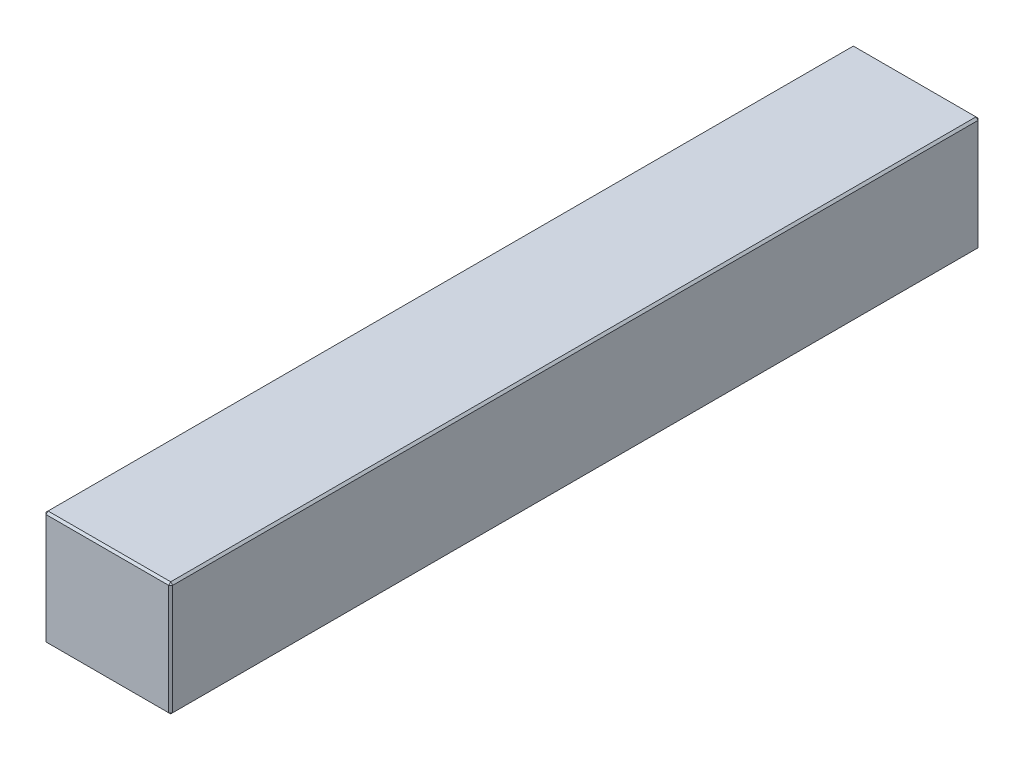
ISO-10303-21;
HEADER;
FILE_DESCRIPTION(('STEP AP214'),'2;1');
FILE_NAME('part.step','',(''),(''),'','','');
FILE_SCHEMA(('AUTOMOTIVE_DESIGN { 1 0 10303 214 1 1 1 1 }'));
ENDSEC;
DATA;
#1=APPLICATION_CONTEXT('core data for automotive mechanical design processes');
#2=APPLICATION_PROTOCOL_DEFINITION('international standard','automotive_design',2000,#1);
#3=PRODUCT_CONTEXT('',#1,'mechanical');
#4=PRODUCT('Part','Part','',(#3));
#5=PRODUCT_RELATED_PRODUCT_CATEGORY('part','',(#4));
#6=PRODUCT_DEFINITION_FORMATION('','',#4);
#7=PRODUCT_DEFINITION_CONTEXT('part definition',#1,'design');
#8=PRODUCT_DEFINITION('design','',#6,#7);
#9=PRODUCT_DEFINITION_SHAPE('','',#8);
#10=(LENGTH_UNIT() NAMED_UNIT(*) SI_UNIT(.MILLI.,.METRE.));
#11=(NAMED_UNIT(*) PLANE_ANGLE_UNIT() SI_UNIT($,.RADIAN.));
#12=(NAMED_UNIT(*) SI_UNIT($,.STERADIAN.) SOLID_ANGLE_UNIT());
#13=UNCERTAINTY_MEASURE_WITH_UNIT(LENGTH_MEASURE(1.E-05),#10,'distance_accuracy_value','');
#14=(GEOMETRIC_REPRESENTATION_CONTEXT(3) GLOBAL_UNCERTAINTY_ASSIGNED_CONTEXT((#13)) GLOBAL_UNIT_ASSIGNED_CONTEXT((#10,
#11,#12)) REPRESENTATION_CONTEXT('',''));
#15=CARTESIAN_POINT('',(0.,0.,0.));
#16=DIRECTION('',(0.,0.,1.));
#17=DIRECTION('',(1.,0.,0.));
#18=AXIS2_PLACEMENT_3D('',#15,#16,#17);
#19=CARTESIAN_POINT('',(-31.,56.,198.));
#20=DIRECTION('',(1.,0.,0.));
#21=DIRECTION('',(0.,0.,-1.));
#22=AXIS2_PLACEMENT_3D('',#19,#20,#21);
#23=PLANE('',#22);
#24=DIRECTION('',(0.,-1.,0.));
#25=VECTOR('',#24,1.);
#26=CARTESIAN_POINT('',(-31.,56.,-197.));
#27=LINE('',#26,#25);
#28=CARTESIAN_POINT('',(-31.,55.,-197.));
#29=VERTEX_POINT('',#28);
#30=CARTESIAN_POINT('',(-31.,1.00000000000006,-197.));
#31=VERTEX_POINT('',#30);
#32=EDGE_CURVE('E114',#29,#31,#27,.T.);
#33=ORIENTED_EDGE('',*,*,#32,.T.);
#34=DIRECTION('',(0.,0.,1.));
#35=VECTOR('',#34,1.);
#36=CARTESIAN_POINT('',(-31.,1.00000000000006,198.));
#37=LINE('',#36,#35);
#38=CARTESIAN_POINT('',(-31.,1.00000000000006,197.));
#39=VERTEX_POINT('',#38);
#40=EDGE_CURVE('E110',#31,#39,#37,.T.);
#41=ORIENTED_EDGE('',*,*,#40,.T.);
#42=DIRECTION('',(0.,1.,0.));
#43=VECTOR('',#42,1.);
#44=CARTESIAN_POINT('',(-31.,56.,197.));
#45=LINE('',#44,#43);
#46=CARTESIAN_POINT('',(-31.,55.,197.));
#47=VERTEX_POINT('',#46);
#48=EDGE_CURVE('E103',#39,#47,#45,.T.);
#49=ORIENTED_EDGE('',*,*,#48,.T.);
#50=DIRECTION('',(0.,0.,-1.));
#51=VECTOR('',#50,1.);
#52=CARTESIAN_POINT('',(-31.,55.,-198.));
#53=LINE('',#52,#51);
#54=EDGE_CURVE('E107',#47,#29,#53,.T.);
#55=ORIENTED_EDGE('',*,*,#54,.T.);
#56=EDGE_LOOP('',(#33,#41,#49,#55));
#57=FACE_BOUND('',#56,.T.);
#58=ADVANCED_FACE('F15',(#57),#23,.F.);
#59=CARTESIAN_POINT('',(31.,56.,198.));
#60=DIRECTION('',(0.,0.,-1.));
#61=DIRECTION('',(-1.,0.,0.));
#62=AXIS2_PLACEMENT_3D('',#59,#60,#61);
#63=PLANE('',#62);
#64=DIRECTION('',(-1.,0.,0.));
#65=VECTOR('',#64,1.);
#66=CARTESIAN_POINT('',(-31.,55.,198.));
#67=LINE('',#66,#65);
#68=CARTESIAN_POINT('',(30.,55.,198.));
#69=VERTEX_POINT('',#68);
#70=CARTESIAN_POINT('',(-30.,55.,198.));
#71=VERTEX_POINT('',#70);
#72=EDGE_CURVE('E164',#69,#71,#67,.T.);
#73=ORIENTED_EDGE('',*,*,#72,.T.);
#74=DIRECTION('',(0.,-1.,0.));
#75=VECTOR('',#74,1.);
#76=CARTESIAN_POINT('',(-30.,56.,198.));
#77=LINE('',#76,#75);
#78=CARTESIAN_POINT('',(-30.,1.00000000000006,198.));
#79=VERTEX_POINT('',#78);
#80=EDGE_CURVE('E122',#71,#79,#77,.T.);
#81=ORIENTED_EDGE('',*,*,#80,.T.);
#82=DIRECTION('',(1.,0.,0.));
#83=VECTOR('',#82,1.);
#84=CARTESIAN_POINT('',(31.,1.00000000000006,198.));
#85=LINE('',#84,#83);
#86=CARTESIAN_POINT('',(30.,1.00000000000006,198.));
#87=VERTEX_POINT('',#86);
#88=EDGE_CURVE('E168',#79,#87,#85,.T.);
#89=ORIENTED_EDGE('',*,*,#88,.T.);
#90=DIRECTION('',(0.,1.,0.));
#91=VECTOR('',#90,1.);
#92=CARTESIAN_POINT('',(30.,56.,198.));
#93=LINE('',#92,#91);
#94=EDGE_CURVE('E166',#87,#69,#93,.T.);
#95=ORIENTED_EDGE('',*,*,#94,.T.);
#96=EDGE_LOOP('',(#73,#81,#89,#95));
#97=FACE_BOUND('',#96,.T.);
#98=ADVANCED_FACE('F275',(#97),#63,.F.);
#99=CARTESIAN_POINT('',(31.,56.,198.));
#100=DIRECTION('',(-1.,0.,0.));
#101=DIRECTION('',(0.,0.,1.));
#102=AXIS2_PLACEMENT_3D('',#99,#100,#101);
#103=PLANE('',#102);
#104=DIRECTION('',(0.,0.,-1.));
#105=VECTOR('',#104,1.);
#106=CARTESIAN_POINT('',(31.,1.00000000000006,198.));
#107=LINE('',#106,#105);
#108=CARTESIAN_POINT('',(31.,1.00000000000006,197.));
#109=VERTEX_POINT('',#108);
#110=CARTESIAN_POINT('',(31.,1.00000000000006,-197.));
#111=VERTEX_POINT('',#110);
#112=EDGE_CURVE('E159',#109,#111,#107,.T.);
#113=ORIENTED_EDGE('',*,*,#112,.T.);
#114=DIRECTION('',(0.,1.,0.));
#115=VECTOR('',#114,1.);
#116=CARTESIAN_POINT('',(31.,56.,-197.));
#117=LINE('',#116,#115);
#118=CARTESIAN_POINT('',(31.,55.,-197.));
#119=VERTEX_POINT('',#118);
#120=EDGE_CURVE('E161',#111,#119,#117,.T.);
#121=ORIENTED_EDGE('',*,*,#120,.T.);
#122=DIRECTION('',(0.,0.,1.));
#123=VECTOR('',#122,1.);
#124=CARTESIAN_POINT('',(31.,55.,198.));
#125=LINE('',#124,#123);
#126=CARTESIAN_POINT('',(31.,55.,197.));
#127=VERTEX_POINT('',#126);
#128=EDGE_CURVE('E155',#119,#127,#125,.T.);
#129=ORIENTED_EDGE('',*,*,#128,.T.);
#130=DIRECTION('',(0.,-1.,0.));
#131=VECTOR('',#130,1.);
#132=CARTESIAN_POINT('',(31.,56.,197.));
#133=LINE('',#132,#131);
#134=EDGE_CURVE('E157',#127,#109,#133,.T.);
#135=ORIENTED_EDGE('',*,*,#134,.T.);
#136=EDGE_LOOP('',(#113,#121,#129,#135));
#137=FACE_BOUND('',#136,.T.);
#138=ADVANCED_FACE('F254',(#137),#103,.F.);
#139=CARTESIAN_POINT('',(31.,56.,-198.));
#140=DIRECTION('',(0.,0.,1.));
#141=DIRECTION('',(1.,0.,0.));
#142=AXIS2_PLACEMENT_3D('',#139,#140,#141);
#143=PLANE('',#142);
#144=DIRECTION('',(0.,-1.,0.));
#145=VECTOR('',#144,1.);
#146=CARTESIAN_POINT('',(30.,56.,-198.));
#147=LINE('',#146,#145);
#148=CARTESIAN_POINT('',(30.,55.,-198.));
#149=VERTEX_POINT('',#148);
#150=CARTESIAN_POINT('',(30.,1.00000000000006,-198.));
#151=VERTEX_POINT('',#150);
#152=EDGE_CURVE('E148',#149,#151,#147,.T.);
#153=ORIENTED_EDGE('',*,*,#152,.T.);
#154=DIRECTION('',(-1.,0.,0.));
#155=VECTOR('',#154,1.);
#156=CARTESIAN_POINT('',(31.,1.00000000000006,-198.));
#157=LINE('',#156,#155);
#158=CARTESIAN_POINT('',(-30.,1.00000000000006,-198.));
#159=VERTEX_POINT('',#158);
#160=EDGE_CURVE('E153',#151,#159,#157,.T.);
#161=ORIENTED_EDGE('',*,*,#160,.T.);
#162=DIRECTION('',(0.,1.,0.));
#163=VECTOR('',#162,1.);
#164=CARTESIAN_POINT('',(-30.,56.,-198.));
#165=LINE('',#164,#163);
#166=CARTESIAN_POINT('',(-30.,55.,-198.));
#167=VERTEX_POINT('',#166);
#168=EDGE_CURVE('E150',#159,#167,#165,.T.);
#169=ORIENTED_EDGE('',*,*,#168,.T.);
#170=DIRECTION('',(1.,0.,0.));
#171=VECTOR('',#170,1.);
#172=CARTESIAN_POINT('',(31.,55.,-198.));
#173=LINE('',#172,#171);
#174=EDGE_CURVE('E146',#167,#149,#173,.T.);
#175=ORIENTED_EDGE('',*,*,#174,.T.);
#176=EDGE_LOOP('',(#153,#161,#169,#175));
#177=FACE_BOUND('',#176,.T.);
#178=ADVANCED_FACE('F284',(#177),#143,.F.);
#179=CARTESIAN_POINT('',(0.,56.,0.));
#180=DIRECTION('',(0.,1.,0.));
#181=DIRECTION('',(0.,0.,1.));
#182=AXIS2_PLACEMENT_3D('',#179,#180,#181);
#183=PLANE('',#182);
#184=DIRECTION('',(0.,0.,-1.));
#185=VECTOR('',#184,1.);
#186=CARTESIAN_POINT('',(30.,56.,-198.));
#187=LINE('',#186,#185);
#188=CARTESIAN_POINT('',(30.,56.,197.));
#189=VERTEX_POINT('',#188);
#190=CARTESIAN_POINT('',(30.,56.,-197.));
#191=VERTEX_POINT('',#190);
#192=EDGE_CURVE('E24',#189,#191,#187,.T.);
#193=ORIENTED_EDGE('',*,*,#192,.T.);
#194=DIRECTION('',(-1.,0.,0.));
#195=VECTOR('',#194,1.);
#196=CARTESIAN_POINT('',(-31.,56.,-197.));
#197=LINE('',#196,#195);
#198=CARTESIAN_POINT('',(-30.,56.,-197.));
#199=VERTEX_POINT('',#198);
#200=EDGE_CURVE('E9',#191,#199,#197,.T.);
#201=ORIENTED_EDGE('',*,*,#200,.T.);
#202=DIRECTION('',(0.,0.,1.));
#203=VECTOR('',#202,1.);
#204=CARTESIAN_POINT('',(-30.,56.,198.));
#205=LINE('',#204,#203);
#206=CARTESIAN_POINT('',(-30.,56.,197.));
#207=VERTEX_POINT('',#206);
#208=EDGE_CURVE('E180',#199,#207,#205,.T.);
#209=ORIENTED_EDGE('',*,*,#208,.T.);
#210=DIRECTION('',(1.,0.,0.));
#211=VECTOR('',#210,1.);
#212=CARTESIAN_POINT('',(31.,56.,197.));
#213=LINE('',#212,#211);
#214=EDGE_CURVE('E35',#207,#189,#213,.T.);
#215=ORIENTED_EDGE('',*,*,#214,.T.);
#216=EDGE_LOOP('',(#193,#201,#209,#215));
#217=FACE_BOUND('',#216,.T.);
#218=ADVANCED_FACE('F350',(#217),#183,.T.);
#219=CARTESIAN_POINT('',(0.,0.,0.));
#220=DIRECTION('',(0.,1.,0.));
#221=DIRECTION('',(0.,0.,1.));
#222=AXIS2_PLACEMENT_3D('',#219,#220,#221);
#223=PLANE('',#222);
#224=DIRECTION('',(0.,0.,1.));
#225=VECTOR('',#224,1.);
#226=CARTESIAN_POINT('',(30.,0.,0.));
#227=LINE('',#226,#225);
#228=CARTESIAN_POINT('',(30.,0.,-197.));
#229=VERTEX_POINT('',#228);
#230=CARTESIAN_POINT('',(30.,0.,197.));
#231=VERTEX_POINT('',#230);
#232=EDGE_CURVE('E171',#229,#231,#227,.T.);
#233=ORIENTED_EDGE('',*,*,#232,.T.);
#234=DIRECTION('',(-1.,0.,0.));
#235=VECTOR('',#234,1.);
#236=CARTESIAN_POINT('',(0.,0.,197.));
#237=LINE('',#236,#235);
#238=CARTESIAN_POINT('',(-30.,0.,197.));
#239=VERTEX_POINT('',#238);
#240=EDGE_CURVE('E177',#231,#239,#237,.T.);
#241=ORIENTED_EDGE('',*,*,#240,.T.);
#242=DIRECTION('',(0.,0.,-1.));
#243=VECTOR('',#242,1.);
#244=CARTESIAN_POINT('',(-30.,0.,0.));
#245=LINE('',#244,#243);
#246=CARTESIAN_POINT('',(-30.,0.,-197.));
#247=VERTEX_POINT('',#246);
#248=EDGE_CURVE('E175',#239,#247,#245,.T.);
#249=ORIENTED_EDGE('',*,*,#248,.T.);
#250=DIRECTION('',(1.,0.,0.));
#251=VECTOR('',#250,1.);
#252=CARTESIAN_POINT('',(0.,0.,-197.));
#253=LINE('',#252,#251);
#254=EDGE_CURVE('E173',#247,#229,#253,.T.);
#255=ORIENTED_EDGE('',*,*,#254,.T.);
#256=EDGE_LOOP('',(#233,#241,#249,#255));
#257=FACE_BOUND('',#256,.T.);
#258=ADVANCED_FACE('F246',(#257),#223,.F.);
#259=CARTESIAN_POINT('',(31.,56.,197.));
#260=DIRECTION('',(-0.707106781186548,0.,-0.707106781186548));
#261=DIRECTION('',(0.,-1.,0.));
#262=AXIS2_PLACEMENT_3D('',#259,#260,#261);
#263=PLANE('',#262);
#264=DIRECTION('',(-0.707106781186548,0.,0.707106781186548));
#265=VECTOR('',#264,1.);
#266=CARTESIAN_POINT('',(30.,55.,198.));
#267=LINE('',#266,#265);
#268=EDGE_CURVE('E19',#69,#127,#267,.F.);
#269=ORIENTED_EDGE('',*,*,#268,.F.);
#270=ORIENTED_EDGE('',*,*,#94,.F.);
#271=DIRECTION('',(0.707106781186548,0.,-0.707106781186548));
#272=VECTOR('',#271,1.);
#273=CARTESIAN_POINT('',(30.,1.00000000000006,198.));
#274=LINE('',#273,#272);
#275=EDGE_CURVE('E142',#109,#87,#274,.F.);
#276=ORIENTED_EDGE('',*,*,#275,.F.);
#277=ORIENTED_EDGE('',*,*,#134,.F.);
#278=EDGE_LOOP('',(#269,#270,#276,#277));
#279=FACE_BOUND('',#278,.T.);
#280=ADVANCED_FACE('F17',(#279),#263,.F.);
#281=CARTESIAN_POINT('',(30.,55.,198.));
#282=DIRECTION('',(0.577350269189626,0.577350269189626,0.577350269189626));
#283=DIRECTION('',(0.707106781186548,0.,-0.707106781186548));
#284=AXIS2_PLACEMENT_3D('',#281,#282,#283);
#285=PLANE('',#284);
#286=DIRECTION('',(0.,-0.707106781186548,0.707106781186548));
#287=VECTOR('',#286,1.);
#288=CARTESIAN_POINT('',(30.,55.,198.));
#289=LINE('',#288,#287);
#290=EDGE_CURVE('E226',#69,#189,#289,.F.);
#291=ORIENTED_EDGE('',*,*,#290,.F.);
#292=ORIENTED_EDGE('',*,*,#268,.T.);
#293=DIRECTION('',(-0.707106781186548,0.707106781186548,0.));
#294=VECTOR('',#293,1.);
#295=CARTESIAN_POINT('',(30.5,55.5,197.));
#296=LINE('',#295,#294);
#297=EDGE_CURVE('E228',#189,#127,#296,.F.);
#298=ORIENTED_EDGE('',*,*,#297,.F.);
#299=EDGE_LOOP('',(#291,#292,#298));
#300=FACE_BOUND('',#299,.T.);
#301=ADVANCED_FACE('F270',(#300),#285,.T.);
#302=CARTESIAN_POINT('',(30.,1.00000000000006,198.));
#303=DIRECTION('',(0.577350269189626,-0.577350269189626,0.577350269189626));
#304=DIRECTION('',(0.707106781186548,0.,-0.707106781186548));
#305=AXIS2_PLACEMENT_3D('',#302,#303,#304);
#306=PLANE('',#305);
#307=DIRECTION('',(-0.707106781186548,-0.707106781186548,0.));
#308=VECTOR('',#307,1.);
#309=CARTESIAN_POINT('',(30.5,0.500000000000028,197.));
#310=LINE('',#309,#308);
#311=EDGE_CURVE('E220',#109,#231,#310,.T.);
#312=ORIENTED_EDGE('',*,*,#311,.F.);
#313=ORIENTED_EDGE('',*,*,#275,.T.);
#314=DIRECTION('',(0.,0.707106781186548,0.707106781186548));
#315=VECTOR('',#314,1.);
#316=CARTESIAN_POINT('',(30.,1.00000000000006,198.));
#317=LINE('',#316,#315);
#318=EDGE_CURVE('E223',#231,#87,#317,.T.);
#319=ORIENTED_EDGE('',*,*,#318,.F.);
#320=EDGE_LOOP('',(#312,#313,#319));
#321=FACE_BOUND('',#320,.T.);
#322=ADVANCED_FACE('F235',(#321),#306,.T.);
#323=CARTESIAN_POINT('',(30.,56.,0.));
#324=DIRECTION('',(0.707106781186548,0.707106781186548,0.));
#325=DIRECTION('',(0.,0.,1.));
#326=AXIS2_PLACEMENT_3D('',#323,#324,#325);
#327=PLANE('',#326);
#328=ORIENTED_EDGE('',*,*,#297,.T.);
#329=ORIENTED_EDGE('',*,*,#128,.F.);
#330=DIRECTION('',(0.707106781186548,-0.707106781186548,0.));
#331=VECTOR('',#330,1.);
#332=CARTESIAN_POINT('',(31.,55.,-197.));
#333=LINE('',#332,#331);
#334=EDGE_CURVE('E215',#191,#119,#333,.T.);
#335=ORIENTED_EDGE('',*,*,#334,.F.);
#336=ORIENTED_EDGE('',*,*,#192,.F.);
#337=EDGE_LOOP('',(#328,#329,#335,#336));
#338=FACE_BOUND('',#337,.T.);
#339=ADVANCED_FACE('F265',(#338),#327,.T.);
#340=CARTESIAN_POINT('',(0.,56.,197.));
#341=DIRECTION('',(0.,0.707106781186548,0.707106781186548));
#342=DIRECTION('',(-1.,0.,0.));
#343=AXIS2_PLACEMENT_3D('',#340,#341,#342);
#344=PLANE('',#343);
#345=ORIENTED_EDGE('',*,*,#290,.T.);
#346=ORIENTED_EDGE('',*,*,#214,.F.);
#347=DIRECTION('',(0.,0.707106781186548,-0.707106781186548));
#348=VECTOR('',#347,1.);
#349=CARTESIAN_POINT('',(-30.,55.5,197.5));
#350=LINE('',#349,#348);
#351=EDGE_CURVE('E126',#71,#207,#350,.T.);
#352=ORIENTED_EDGE('',*,*,#351,.F.);
#353=ORIENTED_EDGE('',*,*,#72,.F.);
#354=EDGE_LOOP('',(#345,#346,#352,#353));
#355=FACE_BOUND('',#354,.T.);
#356=ADVANCED_FACE('F273',(#355),#344,.T.);
#357=CARTESIAN_POINT('',(-30.,56.,198.));
#358=DIRECTION('',(0.707106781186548,0.,-0.707106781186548));
#359=DIRECTION('',(0.,-1.,0.));
#360=AXIS2_PLACEMENT_3D('',#357,#358,#359);
#361=PLANE('',#360);
#362=DIRECTION('',(0.707106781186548,0.,0.707106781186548));
#363=VECTOR('',#362,1.);
#364=CARTESIAN_POINT('',(-30.,1.00000000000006,198.));
#365=LINE('',#364,#363);
#366=EDGE_CURVE('E127',#79,#39,#365,.F.);
#367=ORIENTED_EDGE('',*,*,#366,.F.);
#368=ORIENTED_EDGE('',*,*,#80,.F.);
#369=DIRECTION('',(-0.707106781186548,0.,-0.707106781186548));
#370=VECTOR('',#369,1.);
#371=CARTESIAN_POINT('',(-31.,55.,197.));
#372=LINE('',#371,#370);
#373=EDGE_CURVE('E118',#47,#71,#372,.F.);
#374=ORIENTED_EDGE('',*,*,#373,.F.);
#375=ORIENTED_EDGE('',*,*,#48,.F.);
#376=EDGE_LOOP('',(#367,#368,#374,#375));
#377=FACE_BOUND('',#376,.T.);
#378=ADVANCED_FACE('F120',(#377),#361,.F.);
#379=CARTESIAN_POINT('',(31.,1.00000000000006,198.));
#380=DIRECTION('',(0.,0.707106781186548,-0.707106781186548));
#381=DIRECTION('',(1.,0.,0.));
#382=AXIS2_PLACEMENT_3D('',#379,#380,#381);
#383=PLANE('',#382);
#384=ORIENTED_EDGE('',*,*,#318,.T.);
#385=ORIENTED_EDGE('',*,*,#88,.F.);
#386=DIRECTION('',(0.,-0.707106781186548,-0.707106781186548));
#387=VECTOR('',#386,1.);
#388=CARTESIAN_POINT('',(-30.,1.00000000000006,198.));
#389=LINE('',#388,#387);
#390=EDGE_CURVE('E211',#239,#79,#389,.F.);
#391=ORIENTED_EDGE('',*,*,#390,.F.);
#392=ORIENTED_EDGE('',*,*,#240,.F.);
#393=EDGE_LOOP('',(#384,#385,#391,#392));
#394=FACE_BOUND('',#393,.T.);
#395=ADVANCED_FACE('F243',(#394),#383,.F.);
#396=CARTESIAN_POINT('',(31.,1.00000000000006,198.));
#397=DIRECTION('',(-0.707106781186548,0.707106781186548,0.));
#398=DIRECTION('',(0.,0.,-1.));
#399=AXIS2_PLACEMENT_3D('',#396,#397,#398);
#400=PLANE('',#399);
#401=ORIENTED_EDGE('',*,*,#311,.T.);
#402=ORIENTED_EDGE('',*,*,#232,.F.);
#403=DIRECTION('',(0.707106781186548,0.707106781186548,0.));
#404=VECTOR('',#403,1.);
#405=CARTESIAN_POINT('',(30.5,0.500000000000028,-197.));
#406=LINE('',#405,#404);
#407=EDGE_CURVE('E208',#111,#229,#406,.F.);
#408=ORIENTED_EDGE('',*,*,#407,.F.);
#409=ORIENTED_EDGE('',*,*,#112,.F.);
#410=EDGE_LOOP('',(#401,#402,#408,#409));
#411=FACE_BOUND('',#410,.T.);
#412=ADVANCED_FACE('F251',(#411),#400,.F.);
#413=CARTESIAN_POINT('',(30.,56.,-198.));
#414=DIRECTION('',(-0.707106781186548,0.,0.707106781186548));
#415=DIRECTION('',(0.,-1.,0.));
#416=AXIS2_PLACEMENT_3D('',#413,#414,#415);
#417=PLANE('',#416);
#418=DIRECTION('',(0.707106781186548,0.,0.707106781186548));
#419=VECTOR('',#418,1.);
#420=CARTESIAN_POINT('',(31.,55.,-197.));
#421=LINE('',#420,#419);
#422=EDGE_CURVE('E217',#119,#149,#421,.F.);
#423=ORIENTED_EDGE('',*,*,#422,.F.);
#424=ORIENTED_EDGE('',*,*,#120,.F.);
#425=DIRECTION('',(-0.707106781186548,0.,-0.707106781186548));
#426=VECTOR('',#425,1.);
#427=CARTESIAN_POINT('',(30.,1.00000000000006,-198.));
#428=LINE('',#427,#426);
#429=EDGE_CURVE('E205',#151,#111,#428,.F.);
#430=ORIENTED_EDGE('',*,*,#429,.F.);
#431=ORIENTED_EDGE('',*,*,#152,.F.);
#432=EDGE_LOOP('',(#423,#424,#430,#431));
#433=FACE_BOUND('',#432,.T.);
#434=ADVANCED_FACE('F258',(#433),#417,.F.);
#435=CARTESIAN_POINT('',(31.,55.,-197.));
#436=DIRECTION('',(0.577350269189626,0.577350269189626,-0.577350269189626));
#437=DIRECTION('',(-0.707106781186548,0.,-0.707106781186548));
#438=AXIS2_PLACEMENT_3D('',#435,#436,#437);
#439=PLANE('',#438);
#440=ORIENTED_EDGE('',*,*,#334,.T.);
#441=ORIENTED_EDGE('',*,*,#422,.T.);
#442=DIRECTION('',(0.,0.707106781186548,0.707106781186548));
#443=VECTOR('',#442,1.);
#444=CARTESIAN_POINT('',(30.,55.5,-197.5));
#445=LINE('',#444,#443);
#446=EDGE_CURVE('E134',#191,#149,#445,.F.);
#447=ORIENTED_EDGE('',*,*,#446,.F.);
#448=EDGE_LOOP('',(#440,#441,#447));
#449=FACE_BOUND('',#448,.T.);
#450=ADVANCED_FACE('F325',(#449),#439,.T.);
#451=CARTESIAN_POINT('',(-31.,55.,197.));
#452=DIRECTION('',(-0.577350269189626,0.577350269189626,0.577350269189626));
#453=DIRECTION('',(0.707106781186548,0.,0.707106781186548));
#454=AXIS2_PLACEMENT_3D('',#451,#452,#453);
#455=PLANE('',#454);
#456=ORIENTED_EDGE('',*,*,#373,.T.);
#457=ORIENTED_EDGE('',*,*,#351,.T.);
#458=DIRECTION('',(-0.707106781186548,-0.707106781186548,0.));
#459=VECTOR('',#458,1.);
#460=CARTESIAN_POINT('',(-31.,55.,197.));
#461=LINE('',#460,#459);
#462=EDGE_CURVE('E130',#47,#207,#461,.F.);
#463=ORIENTED_EDGE('',*,*,#462,.F.);
#464=EDGE_LOOP('',(#456,#457,#463));
#465=FACE_BOUND('',#464,.T.);
#466=ADVANCED_FACE('F131',(#465),#455,.T.);
#467=CARTESIAN_POINT('',(-30.,1.00000000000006,198.));
#468=DIRECTION('',(-0.577350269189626,-0.577350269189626,0.577350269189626));
#469=DIRECTION('',(0.707106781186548,0.,0.707106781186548));
#470=AXIS2_PLACEMENT_3D('',#467,#468,#469);
#471=PLANE('',#470);
#472=ORIENTED_EDGE('',*,*,#390,.T.);
#473=ORIENTED_EDGE('',*,*,#366,.T.);
#474=DIRECTION('',(-0.707106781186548,0.707106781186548,0.));
#475=VECTOR('',#474,1.);
#476=CARTESIAN_POINT('',(-30.5,0.500000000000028,197.));
#477=LINE('',#476,#475);
#478=EDGE_CURVE('E135',#239,#39,#477,.T.);
#479=ORIENTED_EDGE('',*,*,#478,.F.);
#480=EDGE_LOOP('',(#472,#473,#479));
#481=FACE_BOUND('',#480,.T.);
#482=ADVANCED_FACE('F318',(#481),#471,.T.);
#483=CARTESIAN_POINT('',(30.,1.00000000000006,-198.));
#484=DIRECTION('',(0.577350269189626,-0.577350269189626,-0.577350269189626));
#485=DIRECTION('',(-0.707106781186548,0.,-0.707106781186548));
#486=AXIS2_PLACEMENT_3D('',#483,#484,#485);
#487=PLANE('',#486);
#488=ORIENTED_EDGE('',*,*,#429,.T.);
#489=ORIENTED_EDGE('',*,*,#407,.T.);
#490=DIRECTION('',(0.,-0.707106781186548,0.707106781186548));
#491=VECTOR('',#490,1.);
#492=CARTESIAN_POINT('',(30.,1.00000000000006,-198.));
#493=LINE('',#492,#491);
#494=EDGE_CURVE('E198',#151,#229,#493,.T.);
#495=ORIENTED_EDGE('',*,*,#494,.F.);
#496=EDGE_LOOP('',(#488,#489,#495));
#497=FACE_BOUND('',#496,.T.);
#498=ADVANCED_FACE('F314',(#497),#487,.T.);
#499=CARTESIAN_POINT('',(0.,56.,-197.));
#500=DIRECTION('',(0.,0.707106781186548,-0.707106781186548));
#501=DIRECTION('',(1.,0.,0.));
#502=AXIS2_PLACEMENT_3D('',#499,#500,#501);
#503=PLANE('',#502);
#504=ORIENTED_EDGE('',*,*,#446,.T.);
#505=ORIENTED_EDGE('',*,*,#174,.F.);
#506=DIRECTION('',(0.,-0.707106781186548,-0.707106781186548));
#507=VECTOR('',#506,1.);
#508=CARTESIAN_POINT('',(-30.,55.,-198.));
#509=LINE('',#508,#507);
#510=EDGE_CURVE('E195',#199,#167,#509,.T.);
#511=ORIENTED_EDGE('',*,*,#510,.F.);
#512=ORIENTED_EDGE('',*,*,#200,.F.);
#513=EDGE_LOOP('',(#504,#505,#511,#512));
#514=FACE_BOUND('',#513,.T.);
#515=ADVANCED_FACE('F311',(#514),#503,.T.);
#516=CARTESIAN_POINT('',(-30.,56.,0.));
#517=DIRECTION('',(-0.707106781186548,0.707106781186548,0.));
#518=DIRECTION('',(0.,0.,-1.));
#519=AXIS2_PLACEMENT_3D('',#516,#517,#518);
#520=PLANE('',#519);
#521=ORIENTED_EDGE('',*,*,#462,.T.);
#522=ORIENTED_EDGE('',*,*,#208,.F.);
#523=DIRECTION('',(0.707106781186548,0.707106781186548,0.));
#524=VECTOR('',#523,1.);
#525=CARTESIAN_POINT('',(-30.5,55.5,-197.));
#526=LINE('',#525,#524);
#527=EDGE_CURVE('E138',#29,#199,#526,.T.);
#528=ORIENTED_EDGE('',*,*,#527,.F.);
#529=ORIENTED_EDGE('',*,*,#54,.F.);
#530=EDGE_LOOP('',(#521,#522,#528,#529));
#531=FACE_BOUND('',#530,.T.);
#532=ADVANCED_FACE('F137',(#531),#520,.T.);
#533=CARTESIAN_POINT('',(-31.,1.00000000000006,198.));
#534=DIRECTION('',(0.707106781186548,0.707106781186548,0.));
#535=DIRECTION('',(0.,0.,1.));
#536=AXIS2_PLACEMENT_3D('',#533,#534,#535);
#537=PLANE('',#536);
#538=ORIENTED_EDGE('',*,*,#478,.T.);
#539=ORIENTED_EDGE('',*,*,#40,.F.);
#540=DIRECTION('',(0.707106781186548,-0.707106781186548,0.));
#541=VECTOR('',#540,1.);
#542=CARTESIAN_POINT('',(-31.,1.00000000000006,-197.));
#543=LINE('',#542,#541);
#544=EDGE_CURVE('E191',#247,#31,#543,.F.);
#545=ORIENTED_EDGE('',*,*,#544,.F.);
#546=ORIENTED_EDGE('',*,*,#248,.F.);
#547=EDGE_LOOP('',(#538,#539,#545,#546));
#548=FACE_BOUND('',#547,.T.);
#549=ADVANCED_FACE('F304',(#548),#537,.F.);
#550=CARTESIAN_POINT('',(31.,1.00000000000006,-198.));
#551=DIRECTION('',(0.,0.707106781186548,0.707106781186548));
#552=DIRECTION('',(-1.,0.,0.));
#553=AXIS2_PLACEMENT_3D('',#550,#551,#552);
#554=PLANE('',#553);
#555=ORIENTED_EDGE('',*,*,#494,.T.);
#556=ORIENTED_EDGE('',*,*,#254,.F.);
#557=DIRECTION('',(0.,0.707106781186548,-0.707106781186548));
#558=VECTOR('',#557,1.);
#559=CARTESIAN_POINT('',(-30.,0.500000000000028,-197.5));
#560=LINE('',#559,#558);
#561=EDGE_CURVE('E188',#159,#247,#560,.F.);
#562=ORIENTED_EDGE('',*,*,#561,.F.);
#563=ORIENTED_EDGE('',*,*,#160,.F.);
#564=EDGE_LOOP('',(#555,#556,#562,#563));
#565=FACE_BOUND('',#564,.T.);
#566=ADVANCED_FACE('F300',(#565),#554,.F.);
#567=CARTESIAN_POINT('',(-30.,55.,-198.));
#568=DIRECTION('',(-0.577350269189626,0.577350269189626,-0.577350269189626));
#569=DIRECTION('',(-0.707106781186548,0.,0.707106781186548));
#570=AXIS2_PLACEMENT_3D('',#567,#568,#569);
#571=PLANE('',#570);
#572=ORIENTED_EDGE('',*,*,#527,.T.);
#573=ORIENTED_EDGE('',*,*,#510,.T.);
#574=DIRECTION('',(0.707106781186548,0.,-0.707106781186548));
#575=VECTOR('',#574,1.);
#576=CARTESIAN_POINT('',(-30.,55.,-198.));
#577=LINE('',#576,#575);
#578=EDGE_CURVE('E186',#29,#167,#577,.T.);
#579=ORIENTED_EDGE('',*,*,#578,.F.);
#580=EDGE_LOOP('',(#572,#573,#579));
#581=FACE_BOUND('',#580,.T.);
#582=ADVANCED_FACE('F296',(#581),#571,.T.);
#583=CARTESIAN_POINT('',(-31.,1.00000000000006,-197.));
#584=DIRECTION('',(-0.577350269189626,-0.577350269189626,-0.577350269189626));
#585=DIRECTION('',(-0.707106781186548,0.,0.707106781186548));
#586=AXIS2_PLACEMENT_3D('',#583,#584,#585);
#587=PLANE('',#586);
#588=ORIENTED_EDGE('',*,*,#561,.T.);
#589=ORIENTED_EDGE('',*,*,#544,.T.);
#590=DIRECTION('',(-0.707106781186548,0.,0.707106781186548));
#591=VECTOR('',#590,1.);
#592=CARTESIAN_POINT('',(-31.,1.00000000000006,-197.));
#593=LINE('',#592,#591);
#594=EDGE_CURVE('E184',#159,#31,#593,.T.);
#595=ORIENTED_EDGE('',*,*,#594,.F.);
#596=EDGE_LOOP('',(#588,#589,#595));
#597=FACE_BOUND('',#596,.T.);
#598=ADVANCED_FACE('F292',(#597),#587,.T.);
#599=CARTESIAN_POINT('',(-31.,56.,-197.));
#600=DIRECTION('',(0.707106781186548,0.,0.707106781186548));
#601=DIRECTION('',(0.,-1.,0.));
#602=AXIS2_PLACEMENT_3D('',#599,#600,#601);
#603=PLANE('',#602);
#604=ORIENTED_EDGE('',*,*,#578,.T.);
#605=ORIENTED_EDGE('',*,*,#168,.F.);
#606=ORIENTED_EDGE('',*,*,#594,.T.);
#607=ORIENTED_EDGE('',*,*,#32,.F.);
#608=EDGE_LOOP('',(#604,#605,#606,#607));
#609=FACE_BOUND('',#608,.T.);
#610=ADVANCED_FACE('F289',(#609),#603,.F.);
#611=CLOSED_SHELL('',(#58,#98,#138,#178,#218,#258,#280,#301,#322,#339,#356,#378,#395,#412,#434,
#450,#466,#482,#498,#515,#532,#549,#566,#582,#598,#610));
#612=MANIFOLD_SOLID_BREP('B1',#611);
#613=ADVANCED_BREP_SHAPE_REPRESENTATION('',(#18,#612),#14);
#614=SHAPE_DEFINITION_REPRESENTATION(#9,#613);
ENDSEC;
END-ISO-10303-21;
